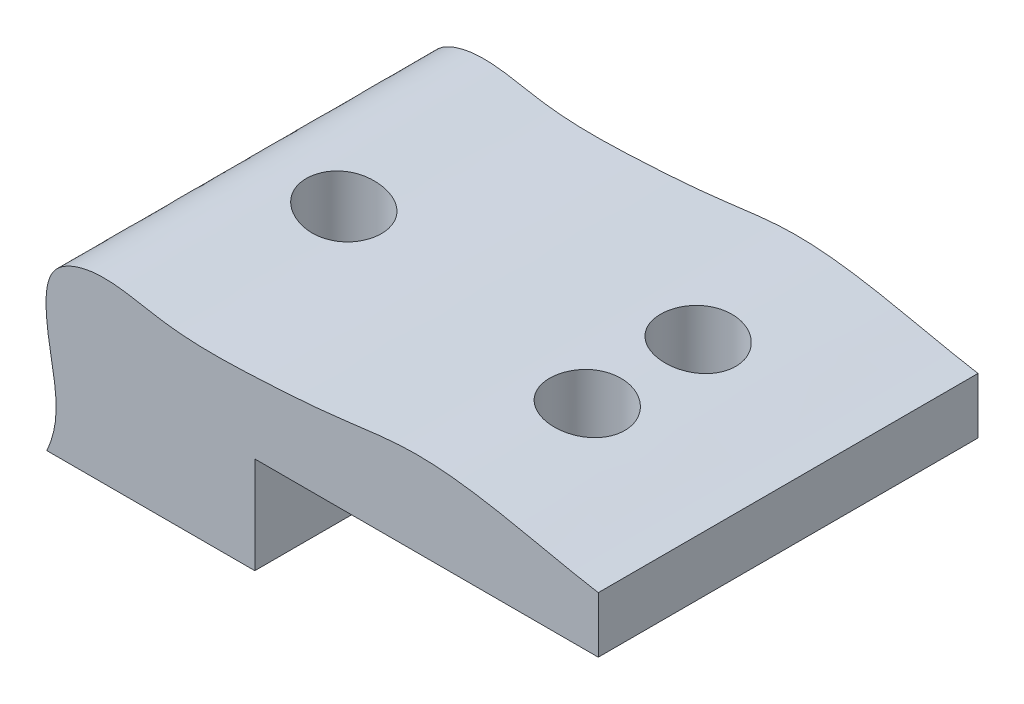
ISO-10303-21;
HEADER;
FILE_DESCRIPTION(('STEP AP214'),'2;1');
FILE_NAME('part.step','',(''),(''),'','','');
FILE_SCHEMA(('AUTOMOTIVE_DESIGN { 1 0 10303 214 1 1 1 1 }'));
ENDSEC;
DATA;
#1=APPLICATION_CONTEXT('core data for automotive mechanical design processes');
#2=APPLICATION_PROTOCOL_DEFINITION('international standard','automotive_design',2000,#1);
#3=PRODUCT_CONTEXT('',#1,'mechanical');
#4=PRODUCT('Part','Part','',(#3));
#5=PRODUCT_RELATED_PRODUCT_CATEGORY('part','',(#4));
#6=PRODUCT_DEFINITION_FORMATION('','',#4);
#7=PRODUCT_DEFINITION_CONTEXT('part definition',#1,'design');
#8=PRODUCT_DEFINITION('design','',#6,#7);
#9=PRODUCT_DEFINITION_SHAPE('','',#8);
#10=(LENGTH_UNIT() NAMED_UNIT(*) SI_UNIT(.MILLI.,.METRE.));
#11=(NAMED_UNIT(*) PLANE_ANGLE_UNIT() SI_UNIT($,.RADIAN.));
#12=(NAMED_UNIT(*) SI_UNIT($,.STERADIAN.) SOLID_ANGLE_UNIT());
#13=UNCERTAINTY_MEASURE_WITH_UNIT(LENGTH_MEASURE(1.E-05),#10,'distance_accuracy_value','');
#14=(GEOMETRIC_REPRESENTATION_CONTEXT(3) GLOBAL_UNCERTAINTY_ASSIGNED_CONTEXT((#13)) GLOBAL_UNIT_ASSIGNED_CONTEXT((#10,
#11,#12)) REPRESENTATION_CONTEXT('',''));
#15=CARTESIAN_POINT('',(0.,0.,0.));
#16=DIRECTION('',(0.,0.,1.));
#17=DIRECTION('',(1.,0.,0.));
#18=AXIS2_PLACEMENT_3D('',#15,#16,#17);
#19=CARTESIAN_POINT('',(-7.62191691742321,162.755280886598,-102.));
#20=CARTESIAN_POINT('',(-40.7298341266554,168.328576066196,-102.));
#21=CARTESIAN_POINT('',(-87.4452188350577,183.088140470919,-102.));
#22=CARTESIAN_POINT('',(-148.487157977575,173.311000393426,-102.));
#23=CARTESIAN_POINT('',(-192.067648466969,170.426961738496,-102.));
#24=CARTESIAN_POINT('',(-237.483766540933,169.225269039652,-102.));
#25=CARTESIAN_POINT('',(-273.222682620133,180.056314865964,-102.));
#26=CARTESIAN_POINT('',(-301.113613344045,167.556907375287,-102.));
#27=CARTESIAN_POINT('',(-302.938840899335,128.156812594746,-102.));
#28=CARTESIAN_POINT('',(-290.551932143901,103.671702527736,-102.));
#29=CARTESIAN_POINT('',(-301.080515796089,81.5,-102.));
#30=B_SPLINE_CURVE_WITH_KNOTS('',3,(#19,#20,#21,#22,#23,#24,#25,#26,#27,#28,#29),.UNSPECIFIED.,
.F.,.F.,(4,1,1,1,1,1,1,1,4),(0.,0.271046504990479,0.369012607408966,0.485907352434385,
0.616935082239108,0.726981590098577,0.771587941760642,0.834411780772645,1.),.UNSPECIFIED.);
#31=DIRECTION('',(0.,0.,1.));
#32=VECTOR('',#31,1.);
#33=SURFACE_OF_LINEAR_EXTRUSION('',#30,#32);
#34=CARTESIAN_POINT('',(-84.,176.961369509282,-49.5));
#35=CARTESIAN_POINT('',(-84.5592458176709,177.022210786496,-49.5000058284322));
#36=CARTESIAN_POINT('',(-85.1186269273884,177.080979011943,-49.4765358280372));
#37=CARTESIAN_POINT('',(-86.2340913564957,177.193886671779,-49.3827075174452));
#38=CARTESIAN_POINT('',(-86.7901739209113,177.248025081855,-49.3123388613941));
#39=CARTESIAN_POINT('',(-87.8954264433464,177.351295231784,-49.124987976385));
#40=CARTESIAN_POINT('',(-88.44458952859,177.400422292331,-49.0079626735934));
#41=CARTESIAN_POINT('',(-89.5315281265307,177.493343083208,-48.7280293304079));
#42=CARTESIAN_POINT('',(-90.0693042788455,177.53713711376,-48.5651238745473));
#43=CARTESIAN_POINT('',(-91.1295546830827,177.619261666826,-48.1945122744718));
#44=CARTESIAN_POINT('',(-91.6520306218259,177.657592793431,-47.9868110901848));
#45=CARTESIAN_POINT('',(-92.677958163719,177.728811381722,-47.5280005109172));
#46=CARTESIAN_POINT('',(-93.1814094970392,177.76169876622,-47.2768905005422));
#47=CARTESIAN_POINT('',(-94.1655064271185,177.822173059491,-46.7330630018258));
#48=CARTESIAN_POINT('',(-94.6461569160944,177.849761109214,-46.4403544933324));
#49=CARTESIAN_POINT('',(-95.5812632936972,177.899922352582,-45.815348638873));
#50=CARTESIAN_POINT('',(-96.0357193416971,177.92249557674,-45.4830515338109));
#51=CARTESIAN_POINT('',(-96.9133240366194,177.962931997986,-44.7826683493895));
#52=CARTESIAN_POINT('',(-97.3365935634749,177.980814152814,-44.4147348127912));
#53=CARTESIAN_POINT('',(-98.1508255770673,178.012462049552,-43.6445457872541));
#54=CARTESIAN_POINT('',(-98.5417881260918,178.026227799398,-43.2422903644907));
#55=CARTESIAN_POINT('',(-99.2886133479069,178.050181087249,-42.4062958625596));
#56=CARTESIAN_POINT('',(-99.6444747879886,178.06036849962,-41.9725556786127));
#57=CARTESIAN_POINT('',(-100.318537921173,178.077741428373,-41.076681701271));
#58=CARTESIAN_POINT('',(-100.636739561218,178.084926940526,-40.6145478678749));
#59=CARTESIAN_POINT('',(-101.23337756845,178.096887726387,-39.6649062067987));
#60=CARTESIAN_POINT('',(-101.511792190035,178.101661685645,-39.1773847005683));
#61=CARTESIAN_POINT('',(-102.026669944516,178.109366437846,-38.1806573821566));
#62=CARTESIAN_POINT('',(-102.263133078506,178.112297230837,-37.6714515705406));
#63=CARTESIAN_POINT('',(-102.692430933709,178.116845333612,-36.6349617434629));
#64=CARTESIAN_POINT('',(-102.885265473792,178.118462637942,-36.1076776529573));
#65=CARTESIAN_POINT('',(-103.225938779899,178.120845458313,-35.038766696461));
#66=CARTESIAN_POINT('',(-103.373777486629,178.121610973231,-34.4971398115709));
#67=CARTESIAN_POINT('',(-103.623655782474,178.122663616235,-33.402309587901));
#68=CARTESIAN_POINT('',(-103.725605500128,178.122949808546,-32.8490857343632));
#69=CARTESIAN_POINT('',(-103.882558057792,178.123308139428,-31.736017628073));
#70=CARTESIAN_POINT('',(-103.937560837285,178.123380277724,-31.1761733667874));
#71=CARTESIAN_POINT('',(-104.000228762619,178.123457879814,-30.0538405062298));
#72=CARTESIAN_POINT('',(-104.007893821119,178.123463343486,-29.4913519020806));
#73=CARTESIAN_POINT('',(-103.975831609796,178.123428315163,-28.3677271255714));
#74=CARTESIAN_POINT('',(-103.93610434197,178.123387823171,-27.8065909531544));
#75=CARTESIAN_POINT('',(-103.809512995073,178.123153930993,-26.689421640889));
#76=CARTESIAN_POINT('',(-103.722629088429,178.122960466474,-26.1333907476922));
#77=CARTESIAN_POINT('',(-103.502329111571,178.122190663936,-25.0306246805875));
#78=CARTESIAN_POINT('',(-103.368913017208,178.12161432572,-24.4838895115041));
#79=CARTESIAN_POINT('',(-103.056496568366,178.119736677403,-23.4035996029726));
#80=CARTESIAN_POINT('',(-102.877495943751,178.118435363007,-22.8700449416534));
#81=CARTESIAN_POINT('',(-102.475184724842,178.114669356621,-21.8199149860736));
#82=CARTESIAN_POINT('',(-102.251874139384,178.112204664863,-21.3033396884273));
#83=CARTESIAN_POINT('',(-101.762557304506,178.105597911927,-20.2908932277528));
#84=CARTESIAN_POINT('',(-101.496555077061,178.101456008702,-19.7950201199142));
#85=CARTESIAN_POINT('',(-100.923738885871,178.090928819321,-18.8274588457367));
#86=CARTESIAN_POINT('',(-100.616924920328,178.084543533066,-18.3557706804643));
#87=CARTESIAN_POINT('',(-99.9646853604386,178.068938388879,-17.4399480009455));
#88=CARTESIAN_POINT('',(-99.6192601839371,178.05971856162,-16.9958131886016));
#89=CARTESIAN_POINT('',(-98.8922772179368,178.037855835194,-16.1382616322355));
#90=CARTESIAN_POINT('',(-98.5107194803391,178.025212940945,-15.7248448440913));
#91=CARTESIAN_POINT('',(-97.7147632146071,177.995966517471,-14.9322172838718));
#92=CARTESIAN_POINT('',(-97.3004099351,177.979368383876,-14.5529608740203));
#93=CARTESIAN_POINT('',(-96.4414030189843,177.941705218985,-13.8307188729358));
#94=CARTESIAN_POINT('',(-95.9967494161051,177.920640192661,-13.4877332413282));
#95=CARTESIAN_POINT('',(-95.0803698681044,177.8736292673,-12.8404659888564));
#96=CARTESIAN_POINT('',(-94.6086445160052,177.847683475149,-12.5361835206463));
#97=CARTESIAN_POINT('',(-93.6415318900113,177.790600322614,-11.9684493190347));
#98=CARTESIAN_POINT('',(-93.146144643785,177.759462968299,-11.7049975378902));
#99=CARTESIAN_POINT('',(-92.1362422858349,177.691870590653,-11.2212016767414));
#100=CARTESIAN_POINT('',(-91.6217646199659,177.655425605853,-11.0007780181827));
#101=CARTESIAN_POINT('',(-90.5765169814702,177.577118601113,-10.603917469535));
#102=CARTESIAN_POINT('',(-90.0457470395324,177.535256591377,-10.4274804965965));
#103=CARTESIAN_POINT('',(-88.9717139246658,177.44619701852,-10.1197490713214));
#104=CARTESIAN_POINT('',(-88.4284506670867,177.398999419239,-9.98845492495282));
#105=CARTESIAN_POINT('',(-87.3332986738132,177.299489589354,-9.77182989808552));
#106=CARTESIAN_POINT('',(-86.7814099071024,177.247177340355,-9.6864991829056));
#107=CARTESIAN_POINT('',(-85.6711513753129,177.137621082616,-9.56208950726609));
#108=CARTESIAN_POINT('',(-85.1127666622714,177.080362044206,-9.52315722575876));
#109=CARTESIAN_POINT('',(-83.9951587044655,176.961540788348,-9.49218945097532));
#110=CARTESIAN_POINT('',(-83.4359354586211,176.899978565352,-9.50015401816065));
#111=CARTESIAN_POINT('',(-82.3205123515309,176.773148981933,-9.56281462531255));
#112=CARTESIAN_POINT('',(-81.7643126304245,176.707881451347,-9.61751281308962));
#113=CARTESIAN_POINT('',(-80.6587893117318,176.574344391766,-9.77316747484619));
#114=CARTESIAN_POINT('',(-80.109465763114,176.506074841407,-9.87412427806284));
#115=CARTESIAN_POINT('',(-79.0163246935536,176.366664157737,-10.1226908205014));
#116=CARTESIAN_POINT('',(-78.4726075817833,176.295502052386,-10.2707304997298));
#117=CARTESIAN_POINT('',(-77.3997605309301,176.151790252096,-10.6120746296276));
#118=CARTESIAN_POINT('',(-76.8706306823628,176.079240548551,-10.8053793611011));
#119=CARTESIAN_POINT('',(-75.8305837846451,175.93367186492,-11.2358982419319));
#120=CARTESIAN_POINT('',(-75.3196675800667,175.860652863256,-11.4731144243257));
#121=CARTESIAN_POINT('',(-74.3196005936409,175.715100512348,-11.9898130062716));
#122=CARTESIAN_POINT('',(-73.8304498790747,175.642567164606,-12.2692955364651));
#123=CARTESIAN_POINT('',(-72.8740089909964,175.498452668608,-12.8706993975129));
#124=CARTESIAN_POINT('',(-72.4068934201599,175.426881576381,-13.1929008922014));
#125=CARTESIAN_POINT('',(-71.5014860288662,175.286187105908,-13.8760199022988));
#126=CARTESIAN_POINT('',(-71.0631943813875,175.217063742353,-14.236937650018));
#127=CARTESIAN_POINT('',(-70.2185899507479,175.082221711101,-14.9950098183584));
#128=CARTESIAN_POINT('',(-69.8122770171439,175.016503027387,-15.3921640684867));
#129=CARTESIAN_POINT('',(-69.0345972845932,174.889388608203,-16.2199688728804));
#130=CARTESIAN_POINT('',(-68.6632302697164,174.827992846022,-16.650619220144));
#131=CARTESIAN_POINT('',(-67.9597744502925,174.710651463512,-17.5404272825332));
#132=CARTESIAN_POINT('',(-67.6275178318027,174.654682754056,-17.9994492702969));
#133=CARTESIAN_POINT('',(-67.0028674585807,174.548673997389,-18.9445126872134));
#134=CARTESIAN_POINT('',(-66.7104736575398,174.49863394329,-19.4305540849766));
#135=CARTESIAN_POINT('',(-66.1678034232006,174.405193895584,-20.4261813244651));
#136=CARTESIAN_POINT('',(-65.9175243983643,174.361793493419,-20.9357657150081));
#137=CARTESIAN_POINT('',(-65.4610136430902,174.282247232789,-21.9748426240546));
#138=CARTESIAN_POINT('',(-65.2547814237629,174.246101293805,-22.5043349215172));
#139=CARTESIAN_POINT('',(-64.8904787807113,174.182017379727,-23.5720922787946));
#140=CARTESIAN_POINT('',(-64.7317943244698,174.153974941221,-24.1101416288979));
#141=CARTESIAN_POINT('',(-64.460114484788,174.105843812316,-25.1980031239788));
#142=CARTESIAN_POINT('',(-64.3471187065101,174.085755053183,-25.747815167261));
#143=CARTESIAN_POINT('',(-64.1677136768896,174.053813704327,-26.8551903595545));
#144=CARTESIAN_POINT('',(-64.1013015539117,174.041960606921,-27.4127530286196));
#145=CARTESIAN_POINT('',(-64.0155813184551,174.026655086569,-28.5316016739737));
#146=CARTESIAN_POINT('',(-63.996272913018,174.023202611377,-29.0928876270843));
#147=CARTESIAN_POINT('',(-64.0048632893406,174.024737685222,-30.2086679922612));
#148=CARTESIAN_POINT('',(-64.0322253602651,174.029629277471,-30.7631667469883));
#149=CARTESIAN_POINT('',(-64.1329178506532,174.047601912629,-31.8678365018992));
#150=CARTESIAN_POINT('',(-64.2062478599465,174.060682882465,-32.4180075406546));
#151=CARTESIAN_POINT('',(-64.398304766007,174.094854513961,-33.5101037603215));
#152=CARTESIAN_POINT('',(-64.5170309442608,174.115945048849,-34.0520290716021));
#153=CARTESIAN_POINT('',(-64.7989653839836,174.165847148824,-35.1238178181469));
#154=CARTESIAN_POINT('',(-64.9621737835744,174.194658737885,-35.6536812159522));
#155=CARTESIAN_POINT('',(-65.3317911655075,174.259603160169,-36.6975329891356));
#156=CARTESIAN_POINT('',(-65.5381914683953,174.29573452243,-37.2115245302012));
#157=CARTESIAN_POINT('',(-65.9926610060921,174.374831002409,-38.2201911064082));
#158=CARTESIAN_POINT('',(-66.240730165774,174.417796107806,-38.7148661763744));
#159=CARTESIAN_POINT('',(-66.7767048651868,174.509979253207,-39.6815290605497));
#160=CARTESIAN_POINT('',(-67.0646105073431,174.559197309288,-40.1535168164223));
#161=CARTESIAN_POINT('',(-67.6781680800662,174.663224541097,-41.071631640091));
#162=CARTESIAN_POINT('',(-68.0038203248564,174.718033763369,-41.5177584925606));
#163=CARTESIAN_POINT('',(-68.6943044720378,174.833136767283,-42.3859088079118));
#164=CARTESIAN_POINT('',(-69.0595255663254,174.893483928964,-42.8076156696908));
#165=CARTESIAN_POINT('',(-69.8235613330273,175.018325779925,-43.6187470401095));
#166=CARTESIAN_POINT('',(-70.2223763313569,175.082820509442,-44.0081712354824));
#167=CARTESIAN_POINT('',(-71.0509186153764,175.21510954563,-44.7522594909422));
#168=CARTESIAN_POINT('',(-71.4806550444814,175.282904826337,-45.1069131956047));
#169=CARTESIAN_POINT('',(-72.3679536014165,175.420872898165,-45.7789817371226));
#170=CARTESIAN_POINT('',(-72.8255155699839,175.491045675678,-46.0963967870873));
#171=CARTESIAN_POINT('',(-73.7719732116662,175.633845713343,-46.6960960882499));
#172=CARTESIAN_POINT('',(-74.2612196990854,175.706493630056,-46.9778219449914));
#173=CARTESIAN_POINT('',(-75.2617350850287,175.852319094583,-47.498914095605));
#174=CARTESIAN_POINT('',(-75.7730054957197,175.925496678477,-47.7382774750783));
#175=CARTESIAN_POINT('',(-76.8135032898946,176.071348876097,-48.1727546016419));
#176=CARTESIAN_POINT('',(-77.3427127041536,176.144023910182,-48.3679112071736));
#177=CARTESIAN_POINT('',(-78.4157146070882,176.287993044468,-48.7128437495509));
#178=CARTESIAN_POINT('',(-78.9595036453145,176.359287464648,-48.8626303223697));
#179=CARTESIAN_POINT('',(-80.2438345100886,176.523370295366,-49.1585800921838));
#180=CARTESIAN_POINT('',(-80.9887842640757,176.61528342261,-49.2864248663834));
#181=CARTESIAN_POINT('',(-82.4890736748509,176.793182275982,-49.4571309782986));
#182=CARTESIAN_POINT('',(-83.2444133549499,176.879167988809,-49.4999921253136));
#183=CARTESIAN_POINT('',(-84.,176.961369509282,-49.5));
#184=B_SPLINE_CURVE_WITH_KNOTS('',3,(#34,#35,#36,#37,#38,#39,#40,#41,#42,#43,#44,#45,#46,#47,
#48,#49,#50,#51,#52,#53,#54,#55,#56,#57,#58,#59,#60,#61,#62,#63,#64,#65,#66,#67,#68,#69,#70,#71,
#72,#73,#74,#75,#76,#77,#78,#79,#80,#81,#82,#83,#84,#85,#86,#87,#88,#89,#90,#91,#92,#93,#94,#95,
#96,#97,#98,#99,#100,#101,#102,#103,#104,#105,#106,#107,#108,#109,#110,#111,#112,#113,#114,#115,
#116,#117,#118,#119,#120,#121,#122,#123,#124,#125,#126,#127,#128,#129,#130,#131,#132,#133,#134,
#135,#136,#137,#138,#139,#140,#141,#142,#143,#144,#145,#146,#147,#148,#149,#150,#151,#152,#153,
#154,#155,#156,#157,#158,#159,#160,#161,#162,#163,#164,#165,#166,#167,#168,#169,#170,#171,#172,
#173,#174,#175,#176,#177,#178,#179,#180,#181,#182,#183),.UNSPECIFIED.,.T.,.F.,(4,2,2,2,2,2,2,2,
2,2,2,2,2,2,2,2,2,2,2,2,2,2,2,2,2,2,2,2,2,2,2,2,2,2,2,2,2,2,2,2,2,2,2,2,2,2,2,2,2,2,2,2,2,2,2,2,
2,2,2,2,2,2,2,2,2,2,2,2,2,2,2,2,2,2,4),(0.,1.68698611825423,3.37434450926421,5.06326430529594,
6.75208897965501,8.44072675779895,10.1293884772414,11.8176862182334,13.5059736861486,
15.1873294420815,16.8686819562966,18.5500934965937,20.2315074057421,21.9138368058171,
23.5961661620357,25.2785025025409,26.960841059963,28.6464602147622,30.3320815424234,
32.0177059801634,33.703330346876,35.3896640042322,37.0759985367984,38.7623430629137,
40.4486872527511,42.1348726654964,43.8210581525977,45.5072253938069,47.1933902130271,
48.8772678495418,50.5611436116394,52.2449825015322,53.9288194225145,55.6095120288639,
57.2902014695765,58.9709023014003,60.6516091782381,62.3376152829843,64.0236235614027,
65.7097093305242,67.3958071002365,69.0977663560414,70.799736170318,72.501784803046,
74.2038386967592,75.9176650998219,77.631501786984,79.3453304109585,81.0591484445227,
82.7653218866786,84.471493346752,86.1775597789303,87.8836072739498,89.566565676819,
91.2495095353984,92.9323496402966,94.6151792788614,96.2787865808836,97.9423790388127,
99.6059451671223,101.269516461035,102.93275377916,104.595988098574,106.259226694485,
107.922479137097,109.60390378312,111.285344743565,112.96728496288,114.649215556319,
116.354859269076,118.060620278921,119.76472040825,121.468420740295,123.747671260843,
126.026926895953),.UNSPECIFIED.);
#185=CARTESIAN_POINT('',(-84.,176.961369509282,-49.5));
#186=VERTEX_POINT('',#185);
#187=EDGE_CURVE('E180',#186,#186,#184,.T.);
#188=ORIENTED_EDGE('',*,*,#187,.F.);
#189=EDGE_LOOP('',(#188));
#190=FACE_BOUND('',#189,.T.);
#191=CARTESIAN_POINT('',(-84.,176.961369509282,9.50000000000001));
#192=CARTESIAN_POINT('',(-84.5592458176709,177.022210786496,9.4999941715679));
#193=CARTESIAN_POINT('',(-85.1186269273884,177.080979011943,9.52346417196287));
#194=CARTESIAN_POINT('',(-86.2340913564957,177.193886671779,9.61729248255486));
#195=CARTESIAN_POINT('',(-86.7901739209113,177.248025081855,9.68766113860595));
#196=CARTESIAN_POINT('',(-87.8954264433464,177.351295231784,9.87501202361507));
#197=CARTESIAN_POINT('',(-88.44458952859,177.400422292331,9.99203732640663));
#198=CARTESIAN_POINT('',(-89.5315281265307,177.493343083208,10.2719706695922));
#199=CARTESIAN_POINT('',(-90.0693042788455,177.53713711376,10.4348761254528));
#200=CARTESIAN_POINT('',(-91.1295546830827,177.619261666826,10.8054877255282));
#201=CARTESIAN_POINT('',(-91.6520306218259,177.657592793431,11.0131889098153));
#202=CARTESIAN_POINT('',(-92.677958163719,177.728811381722,11.4719994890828));
#203=CARTESIAN_POINT('',(-93.1814094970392,177.76169876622,11.7231094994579));
#204=CARTESIAN_POINT('',(-94.1655064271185,177.822173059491,12.2669369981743));
#205=CARTESIAN_POINT('',(-94.6461569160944,177.849761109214,12.5596455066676));
#206=CARTESIAN_POINT('',(-95.5812632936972,177.899922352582,13.184651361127));
#207=CARTESIAN_POINT('',(-96.0357193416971,177.92249557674,13.5169484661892));
#208=CARTESIAN_POINT('',(-96.9133240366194,177.962931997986,14.2173316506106));
#209=CARTESIAN_POINT('',(-97.3365935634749,177.980814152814,14.5852651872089));
#210=CARTESIAN_POINT('',(-98.1508255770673,178.012462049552,15.355454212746));
#211=CARTESIAN_POINT('',(-98.5417881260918,178.026227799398,15.7577096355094));
#212=CARTESIAN_POINT('',(-99.2886133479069,178.050181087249,16.5937041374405));
#213=CARTESIAN_POINT('',(-99.6444747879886,178.06036849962,17.0274443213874));
#214=CARTESIAN_POINT('',(-100.318537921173,178.077741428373,17.923318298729));
#215=CARTESIAN_POINT('',(-100.636739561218,178.084926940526,18.3854521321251));
#216=CARTESIAN_POINT('',(-101.23337756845,178.096887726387,19.3350937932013));
#217=CARTESIAN_POINT('',(-101.511792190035,178.101661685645,19.8226152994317));
#218=CARTESIAN_POINT('',(-102.026669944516,178.109366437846,20.8193426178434));
#219=CARTESIAN_POINT('',(-102.263133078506,178.112297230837,21.3285484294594));
#220=CARTESIAN_POINT('',(-102.692430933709,178.116845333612,22.3650382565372));
#221=CARTESIAN_POINT('',(-102.885265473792,178.118462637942,22.8923223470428));
#222=CARTESIAN_POINT('',(-103.225938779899,178.120845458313,23.9612333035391));
#223=CARTESIAN_POINT('',(-103.373777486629,178.121610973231,24.5028601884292));
#224=CARTESIAN_POINT('',(-103.623655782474,178.122663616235,25.597690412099));
#225=CARTESIAN_POINT('',(-103.725605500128,178.122949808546,26.1509142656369));
#226=CARTESIAN_POINT('',(-103.882558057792,178.123308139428,27.2639823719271));
#227=CARTESIAN_POINT('',(-103.937560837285,178.123380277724,27.8238266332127));
#228=CARTESIAN_POINT('',(-104.000228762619,178.123457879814,28.9461594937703));
#229=CARTESIAN_POINT('',(-104.007893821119,178.123463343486,29.5086480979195));
#230=CARTESIAN_POINT('',(-103.975831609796,178.123428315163,30.6322728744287));
#231=CARTESIAN_POINT('',(-103.93610434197,178.123387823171,31.1934090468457));
#232=CARTESIAN_POINT('',(-103.809512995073,178.123153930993,32.3105783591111));
#233=CARTESIAN_POINT('',(-103.722629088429,178.122960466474,32.8666092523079));
#234=CARTESIAN_POINT('',(-103.502329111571,178.122190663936,33.9693753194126));
#235=CARTESIAN_POINT('',(-103.368913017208,178.12161432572,34.5161104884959));
#236=CARTESIAN_POINT('',(-103.056496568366,178.119736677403,35.5964003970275));
#237=CARTESIAN_POINT('',(-102.877495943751,178.118435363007,36.1299550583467));
#238=CARTESIAN_POINT('',(-102.475184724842,178.114669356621,37.1800850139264));
#239=CARTESIAN_POINT('',(-102.251874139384,178.112204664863,37.6966603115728));
#240=CARTESIAN_POINT('',(-101.762557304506,178.105597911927,38.7091067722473));
#241=CARTESIAN_POINT('',(-101.496555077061,178.101456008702,39.2049798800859));
#242=CARTESIAN_POINT('',(-100.923738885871,178.090928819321,40.1725411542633));
#243=CARTESIAN_POINT('',(-100.616924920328,178.084543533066,40.6442293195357));
#244=CARTESIAN_POINT('',(-99.9646853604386,178.068938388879,41.5600519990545));
#245=CARTESIAN_POINT('',(-99.6192601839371,178.05971856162,42.0041868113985));
#246=CARTESIAN_POINT('',(-98.8922772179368,178.037855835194,42.8617383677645));
#247=CARTESIAN_POINT('',(-98.5107194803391,178.025212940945,43.2751551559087));
#248=CARTESIAN_POINT('',(-97.7147632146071,177.995966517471,44.0677827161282));
#249=CARTESIAN_POINT('',(-97.3004099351,177.979368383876,44.4470391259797));
#250=CARTESIAN_POINT('',(-96.4414030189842,177.941705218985,45.1692811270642));
#251=CARTESIAN_POINT('',(-95.9967494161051,177.920640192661,45.5122667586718));
#252=CARTESIAN_POINT('',(-95.0803698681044,177.8736292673,46.1595340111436));
#253=CARTESIAN_POINT('',(-94.6086445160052,177.847683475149,46.4638164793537));
#254=CARTESIAN_POINT('',(-93.6415318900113,177.790600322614,47.0315506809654));
#255=CARTESIAN_POINT('',(-93.146144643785,177.759462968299,47.2950024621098));
#256=CARTESIAN_POINT('',(-92.1362422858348,177.691870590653,47.7787983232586));
#257=CARTESIAN_POINT('',(-91.6217646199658,177.655425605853,47.9992219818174));
#258=CARTESIAN_POINT('',(-90.5765169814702,177.577118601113,48.396082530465));
#259=CARTESIAN_POINT('',(-90.0457470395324,177.535256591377,48.5725195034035));
#260=CARTESIAN_POINT('',(-88.9717139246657,177.44619701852,48.8802509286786));
#261=CARTESIAN_POINT('',(-88.4284506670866,177.398999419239,49.0115450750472));
#262=CARTESIAN_POINT('',(-87.3332986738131,177.299489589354,49.2281701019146));
#263=CARTESIAN_POINT('',(-86.7814099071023,177.247177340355,49.3135008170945));
#264=CARTESIAN_POINT('',(-85.6711513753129,177.137621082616,49.437910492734));
#265=CARTESIAN_POINT('',(-85.1127666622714,177.080362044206,49.4768427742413));
#266=CARTESIAN_POINT('',(-83.9951587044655,176.961540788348,49.5078105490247));
#267=CARTESIAN_POINT('',(-83.4359354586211,176.899978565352,49.4998459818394));
#268=CARTESIAN_POINT('',(-82.3205123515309,176.773148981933,49.4371853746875));
#269=CARTESIAN_POINT('',(-81.7643126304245,176.707881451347,49.3824871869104));
#270=CARTESIAN_POINT('',(-80.6587893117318,176.574344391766,49.2268325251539));
#271=CARTESIAN_POINT('',(-80.109465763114,176.506074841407,49.1258757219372));
#272=CARTESIAN_POINT('',(-79.0163246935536,176.366664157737,48.8773091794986));
#273=CARTESIAN_POINT('',(-78.4726075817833,176.295502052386,48.7292695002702));
#274=CARTESIAN_POINT('',(-77.3997605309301,176.151790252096,48.3879253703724));
#275=CARTESIAN_POINT('',(-76.8706306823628,176.079240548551,48.1946206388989));
#276=CARTESIAN_POINT('',(-75.8305837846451,175.93367186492,47.7641017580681));
#277=CARTESIAN_POINT('',(-75.3196675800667,175.860652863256,47.5268855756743));
#278=CARTESIAN_POINT('',(-74.3196005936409,175.715100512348,47.0101869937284));
#279=CARTESIAN_POINT('',(-73.8304498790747,175.642567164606,46.7307044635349));
#280=CARTESIAN_POINT('',(-72.8740089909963,175.498452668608,46.1293006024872));
#281=CARTESIAN_POINT('',(-72.4068934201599,175.426881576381,45.8070991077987));
#282=CARTESIAN_POINT('',(-71.5014860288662,175.286187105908,45.1239800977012));
#283=CARTESIAN_POINT('',(-71.0631943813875,175.217063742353,44.763062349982));
#284=CARTESIAN_POINT('',(-70.2185899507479,175.082221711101,44.0049901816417));
#285=CARTESIAN_POINT('',(-69.8122770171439,175.016503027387,43.6078359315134));
#286=CARTESIAN_POINT('',(-69.0345972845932,174.889388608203,42.7800311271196));
#287=CARTESIAN_POINT('',(-68.6632302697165,174.827992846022,42.349380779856));
#288=CARTESIAN_POINT('',(-67.9597744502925,174.710651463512,41.4595727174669));
#289=CARTESIAN_POINT('',(-67.6275178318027,174.654682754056,41.0005507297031));
#290=CARTESIAN_POINT('',(-67.0028674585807,174.548673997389,40.0554873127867));
#291=CARTESIAN_POINT('',(-66.7104736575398,174.49863394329,39.5694459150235));
#292=CARTESIAN_POINT('',(-66.1678034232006,174.405193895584,38.573818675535));
#293=CARTESIAN_POINT('',(-65.9175243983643,174.361793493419,38.064234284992));
#294=CARTESIAN_POINT('',(-65.4610136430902,174.282247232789,37.0251573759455));
#295=CARTESIAN_POINT('',(-65.2547814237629,174.246101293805,36.4956650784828));
#296=CARTESIAN_POINT('',(-64.8904787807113,174.182017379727,35.4279077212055));
#297=CARTESIAN_POINT('',(-64.7317943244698,174.153974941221,34.8898583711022));
#298=CARTESIAN_POINT('',(-64.460114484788,174.105843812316,33.8019968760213));
#299=CARTESIAN_POINT('',(-64.3471187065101,174.085755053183,33.2521848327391));
#300=CARTESIAN_POINT('',(-64.1677136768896,174.053813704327,32.1448096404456));
#301=CARTESIAN_POINT('',(-64.1013015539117,174.041960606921,31.5872469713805));
#302=CARTESIAN_POINT('',(-64.0155813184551,174.026655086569,30.4683983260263));
#303=CARTESIAN_POINT('',(-63.996272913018,174.023202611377,29.9071123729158));
#304=CARTESIAN_POINT('',(-64.0048632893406,174.024737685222,28.7913320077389));
#305=CARTESIAN_POINT('',(-64.0322253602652,174.029629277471,28.2368332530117));
#306=CARTESIAN_POINT('',(-64.1329178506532,174.047601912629,27.1321634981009));
#307=CARTESIAN_POINT('',(-64.2062478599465,174.060682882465,26.5819924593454));
#308=CARTESIAN_POINT('',(-64.398304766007,174.094854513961,25.4898962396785));
#309=CARTESIAN_POINT('',(-64.5170309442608,174.115945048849,24.9479709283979));
#310=CARTESIAN_POINT('',(-64.7989653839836,174.165847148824,23.8761821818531));
#311=CARTESIAN_POINT('',(-64.9621737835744,174.194658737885,23.3463187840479));
#312=CARTESIAN_POINT('',(-65.3317911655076,174.259603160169,22.3024670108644));
#313=CARTESIAN_POINT('',(-65.5381914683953,174.29573452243,21.7884754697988));
#314=CARTESIAN_POINT('',(-65.9926610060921,174.374831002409,20.7798088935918));
#315=CARTESIAN_POINT('',(-66.240730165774,174.417796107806,20.2851338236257));
#316=CARTESIAN_POINT('',(-66.7767048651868,174.509979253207,19.3184709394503));
#317=CARTESIAN_POINT('',(-67.0646105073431,174.559197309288,18.8464831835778));
#318=CARTESIAN_POINT('',(-67.6781680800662,174.663224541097,17.928368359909));
#319=CARTESIAN_POINT('',(-68.0038203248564,174.718033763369,17.4822415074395));
#320=CARTESIAN_POINT('',(-68.6943044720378,174.833136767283,16.6140911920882));
#321=CARTESIAN_POINT('',(-69.0595255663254,174.893483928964,16.1923843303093));
#322=CARTESIAN_POINT('',(-69.8235613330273,175.018325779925,15.3812529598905));
#323=CARTESIAN_POINT('',(-70.2223763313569,175.082820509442,14.9918287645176));
#324=CARTESIAN_POINT('',(-71.0509186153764,175.21510954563,14.2477405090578));
#325=CARTESIAN_POINT('',(-71.4806550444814,175.282904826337,13.8930868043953));
#326=CARTESIAN_POINT('',(-72.3679536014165,175.420872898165,13.2210182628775));
#327=CARTESIAN_POINT('',(-72.8255155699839,175.491045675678,12.9036032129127));
#328=CARTESIAN_POINT('',(-73.7719732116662,175.633845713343,12.3039039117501));
#329=CARTESIAN_POINT('',(-74.2612196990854,175.706493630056,12.0221780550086));
#330=CARTESIAN_POINT('',(-75.2617350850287,175.852319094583,11.5010859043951));
#331=CARTESIAN_POINT('',(-75.7730054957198,175.925496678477,11.2617225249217));
#332=CARTESIAN_POINT('',(-76.8135032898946,176.071348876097,10.8272453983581));
#333=CARTESIAN_POINT('',(-77.3427127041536,176.144023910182,10.6320887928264));
#334=CARTESIAN_POINT('',(-78.4157146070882,176.287993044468,10.2871562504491));
#335=CARTESIAN_POINT('',(-78.9595036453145,176.359287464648,10.1373696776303));
#336=CARTESIAN_POINT('',(-80.2438345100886,176.523370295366,9.84141990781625));
#337=CARTESIAN_POINT('',(-80.9887842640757,176.61528342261,9.71357513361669));
#338=CARTESIAN_POINT('',(-82.4890736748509,176.793182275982,9.54286902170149));
#339=CARTESIAN_POINT('',(-83.2444133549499,176.879167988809,9.50000787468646));
#340=CARTESIAN_POINT('',(-84.,176.961369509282,9.50000000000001));
#341=B_SPLINE_CURVE_WITH_KNOTS('',3,(#191,#192,#193,#194,#195,#196,#197,#198,#199,#200,#201,
#202,#203,#204,#205,#206,#207,#208,#209,#210,#211,#212,#213,#214,#215,#216,#217,#218,#219,#220,
#221,#222,#223,#224,#225,#226,#227,#228,#229,#230,#231,#232,#233,#234,#235,#236,#237,#238,#239,
#240,#241,#242,#243,#244,#245,#246,#247,#248,#249,#250,#251,#252,#253,#254,#255,#256,#257,#258,
#259,#260,#261,#262,#263,#264,#265,#266,#267,#268,#269,#270,#271,#272,#273,#274,#275,#276,#277,
#278,#279,#280,#281,#282,#283,#284,#285,#286,#287,#288,#289,#290,#291,#292,#293,#294,#295,#296,
#297,#298,#299,#300,#301,#302,#303,#304,#305,#306,#307,#308,#309,#310,#311,#312,#313,#314,#315,
#316,#317,#318,#319,#320,#321,#322,#323,#324,#325,#326,#327,#328,#329,#330,#331,#332,#333,#334,
#335,#336,#337,#338,#339,#340),.UNSPECIFIED.,.T.,.F.,(4,2,2,2,2,2,2,2,2,2,2,2,2,2,2,2,2,2,2,2,2,
2,2,2,2,2,2,2,2,2,2,2,2,2,2,2,2,2,2,2,2,2,2,2,2,2,2,2,2,2,2,2,2,2,2,2,2,2,2,2,2,2,2,2,2,2,2,2,2,
2,2,2,2,2,4),(0.,1.68698611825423,3.37434450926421,5.06326430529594,6.75208897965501,
8.44072675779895,10.1293884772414,11.8176862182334,13.5059736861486,15.1873294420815,
16.8686819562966,18.5500934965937,20.2315074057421,21.9138368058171,23.5961661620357,
25.2785025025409,26.960841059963,28.6464602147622,30.3320815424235,32.0177059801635,
33.703330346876,35.3896640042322,37.0759985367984,38.7623430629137,40.4486872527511,
42.1348726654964,43.8210581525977,45.5072253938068,47.1933902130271,48.8772678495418,
50.5611436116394,52.2449825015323,53.9288194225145,55.609512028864,57.2902014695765,
58.9709023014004,60.6516091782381,62.3376152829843,64.0236235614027,65.7097093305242,
67.3958071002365,69.0977663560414,70.799736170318,72.501784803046,74.2038386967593,
75.9176650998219,77.631501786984,79.3453304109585,81.0591484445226,82.7653218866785,
84.471493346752,86.1775597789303,87.8836072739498,89.566565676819,91.2495095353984,
92.9323496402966,94.6151792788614,96.2787865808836,97.9423790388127,99.6059451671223,
101.269516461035,102.93275377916,104.595988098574,106.259226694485,107.922479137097,
109.60390378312,111.285344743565,112.96728496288,114.649215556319,116.354859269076,
118.060620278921,119.76472040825,121.468420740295,123.747671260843,126.026926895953),.UNSPECIFIED.);
#342=CARTESIAN_POINT('',(-84.,176.961369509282,9.50000000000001));
#343=VERTEX_POINT('',#342);
#344=EDGE_CURVE('E204',#343,#343,#341,.T.);
#345=ORIENTED_EDGE('',*,*,#344,.F.);
#346=EDGE_LOOP('',(#345));
#347=FACE_BOUND('',#346,.T.);
#348=CARTESIAN_POINT('',(-243.,172.574085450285,-20.));
#349=CARTESIAN_POINT('',(-243.569277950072,172.670604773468,-19.999996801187));
#350=CARTESIAN_POINT('',(-244.138271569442,172.769446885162,-19.9756777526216));
#351=CARTESIAN_POINT('',(-245.271761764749,172.969712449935,-19.8787030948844));
#352=CARTESIAN_POINT('',(-245.836257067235,173.071136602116,-19.8060342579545));
#353=CARTESIAN_POINT('',(-246.957601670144,173.274608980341,-19.6127871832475));
#354=CARTESIAN_POINT('',(-247.514441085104,173.376657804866,-19.4921521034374));
#355=CARTESIAN_POINT('',(-248.616017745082,173.579243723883,-19.2037624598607));
#356=CARTESIAN_POINT('',(-249.160755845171,173.679780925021,-19.0360112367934));
#357=CARTESIAN_POINT('',(-250.23448527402,173.877489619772,-18.6544055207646));
#358=CARTESIAN_POINT('',(-250.763476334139,173.974661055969,-18.4405502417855));
#359=CARTESIAN_POINT('',(-251.802006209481,174.163981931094,-17.9680310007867));
#360=CARTESIAN_POINT('',(-252.311544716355,174.256131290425,-17.7093663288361));
#361=CARTESIAN_POINT('',(-253.307264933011,174.433980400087,-17.1489513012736));
#362=CARTESIAN_POINT('',(-253.793455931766,174.519682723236,-16.8472182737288));
#363=CARTESIAN_POINT('',(-254.739040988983,174.68359807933,-16.2025409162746));
#364=CARTESIAN_POINT('',(-255.198435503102,174.761811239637,-15.8595972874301));
#365=CARTESIAN_POINT('',(-256.08176951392,174.909155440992,-15.138971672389));
#366=CARTESIAN_POINT('',(-256.506055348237,174.978380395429,-14.7617334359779));
#367=CARTESIAN_POINT('',(-257.321669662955,175.10839676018,-13.9718309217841));
#368=CARTESIAN_POINT('',(-257.712998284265,175.169188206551,-13.5591667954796));
#369=CARTESIAN_POINT('',(-258.459602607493,175.282254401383,-12.7013388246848));
#370=CARTESIAN_POINT('',(-258.814878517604,175.334529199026,-12.2561751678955));
#371=CARTESIAN_POINT('',(-259.486545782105,175.430748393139,-11.3365777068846));
#372=CARTESIAN_POINT('',(-259.80293763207,175.474692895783,-10.8621442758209));
#373=CARTESIAN_POINT('',(-260.38834991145,175.553842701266,-9.89733518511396));
#374=CARTESIAN_POINT('',(-260.658196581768,175.589206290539,-9.40747356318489));
#375=CARTESIAN_POINT('',(-261.156076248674,175.652821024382,-8.40650582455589));
#376=CARTESIAN_POINT('',(-261.384109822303,175.681072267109,-7.89540000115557));
#377=CARTESIAN_POINT('',(-261.796633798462,175.73102339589,-6.85561026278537));
#378=CARTESIAN_POINT('',(-261.981124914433,175.752723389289,-6.32692663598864));
#379=CARTESIAN_POINT('',(-262.305183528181,175.790122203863,-5.25575810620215));
#380=CARTESIAN_POINT('',(-262.444750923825,175.805821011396,-4.71327317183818));
#381=CARTESIAN_POINT('',(-262.677545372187,175.831649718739,-3.62014963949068));
#382=CARTESIAN_POINT('',(-262.770920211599,175.841797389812,-3.06954292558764));
#383=CARTESIAN_POINT('',(-262.911314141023,175.856944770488,-1.9623828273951));
#384=CARTESIAN_POINT('',(-262.958333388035,175.861944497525,-1.40582946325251));
#385=CARTESIAN_POINT('',(-263.005672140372,175.866977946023,-0.290714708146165));
#386=CARTESIAN_POINT('',(-263.005991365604,175.867011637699,0.267846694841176));
#387=CARTESIAN_POINT('',(-262.95992712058,175.862114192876,1.38301960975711));
#388=CARTESIAN_POINT('',(-262.913543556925,175.85718304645,1.9396311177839));
#389=CARTESIAN_POINT('',(-262.774289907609,175.842163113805,3.04794102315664));
#390=CARTESIAN_POINT('',(-262.681337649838,175.832065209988,3.59962897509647));
#391=CARTESIAN_POINT('',(-262.449591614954,175.806363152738,4.69316156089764));
#392=CARTESIAN_POINT('',(-262.31079779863,175.790758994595,5.23500618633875));
#393=CARTESIAN_POINT('',(-261.988403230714,175.753574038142,6.30497650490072));
#394=CARTESIAN_POINT('',(-261.804803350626,175.731993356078,6.83310246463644));
#395=CARTESIAN_POINT('',(-261.394171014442,175.682308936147,7.87187309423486));
#396=CARTESIAN_POINT('',(-261.16713864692,175.654205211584,8.38251779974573));
#397=CARTESIAN_POINT('',(-260.671630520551,175.590950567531,9.38212756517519));
#398=CARTESIAN_POINT('',(-260.403200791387,175.555807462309,9.8711159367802));
#399=CARTESIAN_POINT('',(-259.826754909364,175.477953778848,10.8245389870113));
#400=CARTESIAN_POINT('',(-259.51873883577,175.435243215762,11.2889737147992));
#401=CARTESIAN_POINT('',(-258.865485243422,175.341881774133,12.189996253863));
#402=CARTESIAN_POINT('',(-258.520249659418,175.29123130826,12.6265855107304));
#403=CARTESIAN_POINT('',(-257.795172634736,175.181802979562,13.4689154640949));
#404=CARTESIAN_POINT('',(-257.415331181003,175.12302511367,13.8746561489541));
#405=CARTESIAN_POINT('',(-256.624005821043,174.997413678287,14.6524464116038));
#406=CARTESIAN_POINT('',(-256.212529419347,174.930582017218,15.0245039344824));
#407=CARTESIAN_POINT('',(-255.360914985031,174.789187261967,15.7325918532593));
#408=CARTESIAN_POINT('',(-254.920776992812,174.714624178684,16.0686222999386));
#409=CARTESIAN_POINT('',(-254.01499769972,174.558391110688,16.7025577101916));
#410=CARTESIAN_POINT('',(-253.549354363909,174.476720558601,17.000459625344));
#411=CARTESIAN_POINT('',(-252.595873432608,174.307202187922,17.5563023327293));
#412=CARTESIAN_POINT('',(-252.108035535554,174.219354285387,17.814242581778));
#413=CARTESIAN_POINT('',(-251.106311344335,174.037376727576,18.2920771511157));
#414=CARTESIAN_POINT('',(-250.592150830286,173.943174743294,18.5113690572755));
#415=CARTESIAN_POINT('',(-249.54788846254,173.751152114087,18.9059970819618));
#416=CARTESIAN_POINT('',(-249.017786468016,173.653331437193,19.0813328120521));
#417=CARTESIAN_POINT('',(-247.945026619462,173.455763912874,19.3870532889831));
#418=CARTESIAN_POINT('',(-247.4023666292,173.356016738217,19.5174303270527));
#419=CARTESIAN_POINT('',(-246.308057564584,173.156468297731,19.7324022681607));
#420=CARTESIAN_POINT('',(-245.756408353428,173.056667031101,19.8169964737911));
#421=CARTESIAN_POINT('',(-244.635555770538,172.856794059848,19.9411573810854));
#422=CARTESIAN_POINT('',(-244.066231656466,172.756763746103,19.9797039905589));
#423=CARTESIAN_POINT('',(-242.925666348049,172.56074507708,20.0079958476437));
#424=CARTESIAN_POINT('',(-242.354425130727,172.464756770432,19.9977405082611));
#425=CARTESIAN_POINT('',(-241.214009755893,172.278825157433,19.9282847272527));
#426=CARTESIAN_POINT('',(-240.644835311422,172.188880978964,19.8690913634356));
#427=CARTESIAN_POINT('',(-239.512495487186,172.016872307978,19.7018982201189));
#428=CARTESIAN_POINT('',(-238.949329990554,171.934807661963,19.5938993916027));
#429=CARTESIAN_POINT('',(-237.83883996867,171.779476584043,19.3309284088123));
#430=CARTESIAN_POINT('',(-237.291413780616,171.706131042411,19.1764322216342));
#431=CARTESIAN_POINT('',(-236.210820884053,171.567239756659,18.8210132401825));
#432=CARTESIAN_POINT('',(-235.677654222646,171.5016940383,18.6200902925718));
#433=CARTESIAN_POINT('',(-234.629671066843,171.378200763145,18.1731150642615));
#434=CARTESIAN_POINT('',(-234.114854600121,171.320253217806,17.9270627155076));
#435=CARTESIAN_POINT('',(-233.107541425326,171.21162778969,17.3915101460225));
#436=CARTESIAN_POINT('',(-232.615044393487,171.160949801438,17.102010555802));
#437=CARTESIAN_POINT('',(-231.664956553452,171.067303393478,16.4872995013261));
#438=CARTESIAN_POINT('',(-231.206891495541,171.02421072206,16.1628396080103));
#439=CARTESIAN_POINT('',(-230.319327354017,170.944150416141,15.4762823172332));
#440=CARTESIAN_POINT('',(-229.889827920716,170.907182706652,15.1141853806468));
#441=CARTESIAN_POINT('',(-229.062588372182,170.838863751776,14.3549207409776));
#442=CARTESIAN_POINT('',(-228.664846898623,170.807512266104,13.9577545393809));
#443=CARTESIAN_POINT('',(-227.904032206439,170.749896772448,13.1311568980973));
#444=CARTESIAN_POINT('',(-227.540959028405,170.723632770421,12.7017254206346));
#445=CARTESIAN_POINT('',(-226.853316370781,170.675751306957,11.8151703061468));
#446=CARTESIAN_POINT('',(-226.528620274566,170.654118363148,11.3581457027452));
#447=CARTESIAN_POINT('',(-225.918662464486,170.614892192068,10.4183362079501));
#448=CARTESIAN_POINT('',(-225.63340062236,170.597298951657,9.93555140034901));
#449=CARTESIAN_POINT('',(-225.104368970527,170.565696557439,8.9476450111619));
#450=CARTESIAN_POINT('',(-224.860599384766,170.551687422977,8.44252330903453));
#451=CARTESIAN_POINT('',(-224.416307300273,170.526849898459,7.41352971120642));
#452=CARTESIAN_POINT('',(-224.215784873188,170.516021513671,6.88965778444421));
#453=CARTESIAN_POINT('',(-223.859250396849,170.497195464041,5.82635772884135));
#454=CARTESIAN_POINT('',(-223.703282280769,170.489200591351,5.28691481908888));
#455=CARTESIAN_POINT('',(-223.437237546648,170.475785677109,4.19679757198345));
#456=CARTESIAN_POINT('',(-223.327160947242,170.470365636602,3.64612323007));
#457=CARTESIAN_POINT('',(-223.15368625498,170.4619067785,2.53744872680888));
#458=CARTESIAN_POINT('',(-223.090288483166,170.458867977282,1.97944851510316));
#459=CARTESIAN_POINT('',(-223.010625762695,170.455059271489,0.860085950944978));
#460=CARTESIAN_POINT('',(-222.994360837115,170.454289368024,0.298723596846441));
#461=CARTESIAN_POINT('',(-223.009086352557,170.454989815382,-0.82385549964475));
#462=CARTESIAN_POINT('',(-223.040116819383,170.456462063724,-1.38507171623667));
#463=CARTESIAN_POINT('',(-223.149284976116,170.461705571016,-2.50289312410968));
#464=CARTESIAN_POINT('',(-223.227422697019,170.46547683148,-3.05949831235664));
#465=CARTESIAN_POINT('',(-223.430246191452,170.475456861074,-4.16414223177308));
#466=CARTESIAN_POINT('',(-223.554932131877,170.481665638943,-4.71218093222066));
#467=CARTESIAN_POINT('',(-223.849957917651,170.496739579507,-5.79579165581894));
#468=CARTESIAN_POINT('',(-224.020297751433,170.505604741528,-6.33136368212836));
#469=CARTESIAN_POINT('',(-224.405411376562,170.52628626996,-7.3862405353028));
#470=CARTESIAN_POINT('',(-224.620186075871,170.538102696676,-7.90554502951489));
#471=CARTESIAN_POINT('',(-225.092620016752,170.565050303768,-8.92417743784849));
#472=CARTESIAN_POINT('',(-225.350279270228,170.580181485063,-9.42350534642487));
#473=CARTESIAN_POINT('',(-225.906608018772,170.614181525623,-10.3986065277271));
#474=CARTESIAN_POINT('',(-226.205275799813,170.633050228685,-10.8743807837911));
#475=CARTESIAN_POINT('',(-226.841461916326,170.674997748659,-11.7990068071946));
#476=CARTESIAN_POINT('',(-227.178980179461,170.698076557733,-12.2478586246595));
#477=CARTESIAN_POINT('',(-227.890066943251,170.74892630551,-13.1150306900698));
#478=CARTESIAN_POINT('',(-228.263600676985,170.776692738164,-13.5333797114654));
#479=CARTESIAN_POINT('',(-229.044260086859,170.837455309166,-14.3370552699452));
#480=CARTESIAN_POINT('',(-229.451385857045,170.870451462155,-14.7223817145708));
#481=CARTESIAN_POINT('',(-230.296330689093,170.942201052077,-15.4573733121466));
#482=CARTESIAN_POINT('',(-230.7341563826,170.980955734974,-15.8070307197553));
#483=CARTESIAN_POINT('',(-231.637187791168,171.064712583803,-16.4681396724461));
#484=CARTESIAN_POINT('',(-232.102393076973,171.109714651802,-16.7795918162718));
#485=CARTESIAN_POINT('',(-233.056465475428,171.206385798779,-17.3619784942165));
#486=CARTESIAN_POINT('',(-233.545318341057,171.25805089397,-17.6329370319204));
#487=CARTESIAN_POINT('',(-234.543365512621,171.368448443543,-18.1327553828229));
#488=CARTESIAN_POINT('',(-235.052561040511,171.427181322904,-18.3616126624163));
#489=CARTESIAN_POINT('',(-236.086955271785,171.551921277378,-18.7755119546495));
#490=CARTESIAN_POINT('',(-236.612136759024,171.617920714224,-18.9605993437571));
#491=CARTESIAN_POINT('',(-237.675102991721,171.757399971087,-19.2861161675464));
#492=CARTESIAN_POINT('',(-238.212884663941,171.830877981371,-19.4265563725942));
#493=CARTESIAN_POINT('',(-239.104203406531,171.957825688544,-19.6201576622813));
#494=CARTESIAN_POINT('',(-239.455228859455,172.009114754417,-19.686594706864));
#495=CARTESIAN_POINT('',(-240.159819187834,172.114788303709,-19.8005220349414));
#496=CARTESIAN_POINT('',(-240.513383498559,172.169172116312,-19.8480164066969));
#497=CARTESIAN_POINT('',(-241.222125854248,172.280685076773,-19.924010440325));
#498=CARTESIAN_POINT('',(-241.577303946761,172.337814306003,-19.9525095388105));
#499=CARTESIAN_POINT('',(-242.288358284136,172.454354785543,-19.9905074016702));
#500=CARTESIAN_POINT('',(-242.644234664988,172.513766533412,-20.0000019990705));
#501=CARTESIAN_POINT('',(-243.,172.574085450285,-20.));
#502=B_SPLINE_CURVE_WITH_KNOTS('',3,(#348,#349,#350,#351,#352,#353,#354,#355,#356,#357,#358,
#359,#360,#361,#362,#363,#364,#365,#366,#367,#368,#369,#370,#371,#372,#373,#374,#375,#376,#377,
#378,#379,#380,#381,#382,#383,#384,#385,#386,#387,#388,#389,#390,#391,#392,#393,#394,#395,#396,
#397,#398,#399,#400,#401,#402,#403,#404,#405,#406,#407,#408,#409,#410,#411,#412,#413,#414,#415,
#416,#417,#418,#419,#420,#421,#422,#423,#424,#425,#426,#427,#428,#429,#430,#431,#432,#433,#434,
#435,#436,#437,#438,#439,#440,#441,#442,#443,#444,#445,#446,#447,#448,#449,#450,#451,#452,#453,
#454,#455,#456,#457,#458,#459,#460,#461,#462,#463,#464,#465,#466,#467,#468,#469,#470,#471,#472,
#473,#474,#475,#476,#477,#478,#479,#480,#481,#482,#483,#484,#485,#486,#487,#488,#489,#490,#491,
#492,#493,#494,#495,#496,#497,#498,#499,#500,#501),.UNSPECIFIED.,.T.,.F.,(4,2,2,2,2,2,2,2,2,2,2,
2,2,2,2,2,2,2,2,2,2,2,2,2,2,2,2,2,2,2,2,2,2,2,2,2,2,2,2,2,2,2,2,2,2,2,2,2,2,2,2,2,2,2,2,2,2,2,2,
2,2,2,2,2,2,2,2,2,2,2,2,2,2,2,2,2,4),(0.,1.73188521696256,3.46424444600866,5.19866274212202,
6.93295809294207,8.66728301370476,10.4016354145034,12.1352919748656,13.8689190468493,
15.5826539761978,17.2963815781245,19.0100992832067,20.7237951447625,22.4029516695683,
24.0820850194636,25.7611908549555,27.4403005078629,29.1140027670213,30.7876993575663,
32.4614059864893,34.1351159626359,35.811789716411,37.4884649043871,39.1651074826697,
40.8417466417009,42.5165348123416,44.1913196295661,45.8660174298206,47.5407158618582,
49.2150182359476,50.8893182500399,52.563752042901,54.2382085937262,55.9368165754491,
57.6354395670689,59.3343536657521,61.0332936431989,62.7692108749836,64.5051489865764,
66.2408360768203,67.9764893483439,69.6949474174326,71.4134111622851,73.1318774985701,
74.8503188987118,76.537272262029,78.2242049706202,79.9110654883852,81.5979279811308,
83.2790597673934,84.9601860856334,86.6413214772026,88.3224596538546,90.0052498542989,
91.6880407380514,93.3708431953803,95.0536464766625,96.7378746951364,98.4221040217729,
100.106339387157,101.790574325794,103.474843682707,105.159113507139,106.843312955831,
108.527509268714,110.210095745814,111.892686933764,113.575642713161,115.258572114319,
116.940499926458,118.622528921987,120.302806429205,121.982678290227,123.064969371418,
124.147026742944,125.229116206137,126.311442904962),.UNSPECIFIED.);
#503=CARTESIAN_POINT('',(-243.,172.574085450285,-20.));
#504=VERTEX_POINT('',#503);
#505=EDGE_CURVE('E212',#504,#504,#502,.T.);
#506=ORIENTED_EDGE('',*,*,#505,.F.);
#507=EDGE_LOOP('',(#506));
#508=FACE_BOUND('',#507,.T.);
#509=DIRECTION('',(0.,0.,1.));
#510=VECTOR('',#509,1.);
#511=CARTESIAN_POINT('',(-301.080515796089,81.5,-102.));
#512=LINE('',#511,#510);
#513=CARTESIAN_POINT('',(-301.080515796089,81.5,-102.));
#514=VERTEX_POINT('',#513);
#515=CARTESIAN_POINT('',(-301.080515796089,81.5,100.));
#516=VERTEX_POINT('',#515);
#517=EDGE_CURVE('E54',#514,#516,#512,.T.);
#518=ORIENTED_EDGE('',*,*,#517,.T.);
#519=CARTESIAN_POINT('',(-7.62191691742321,162.755280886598,100.));
#520=CARTESIAN_POINT('',(-40.7298341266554,168.328576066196,100.));
#521=CARTESIAN_POINT('',(-87.4452188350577,183.088140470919,100.));
#522=CARTESIAN_POINT('',(-148.487157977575,173.311000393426,100.));
#523=CARTESIAN_POINT('',(-192.067648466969,170.426961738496,100.));
#524=CARTESIAN_POINT('',(-237.483766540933,169.225269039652,100.));
#525=CARTESIAN_POINT('',(-273.222682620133,180.056314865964,100.));
#526=CARTESIAN_POINT('',(-301.113613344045,167.556907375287,100.));
#527=CARTESIAN_POINT('',(-302.938840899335,128.156812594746,100.));
#528=CARTESIAN_POINT('',(-290.551932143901,103.671702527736,100.));
#529=CARTESIAN_POINT('',(-301.080515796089,81.5,100.));
#530=B_SPLINE_CURVE_WITH_KNOTS('',3,(#519,#520,#521,#522,#523,#524,#525,#526,#527,#528,#529),
.UNSPECIFIED.,.F.,.F.,(4,1,1,1,1,1,1,1,4),(0.,0.271046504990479,0.369012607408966,
0.485907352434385,0.616935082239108,0.726981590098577,0.771587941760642,0.834411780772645,1.),.UNSPECIFIED.);
#531=CARTESIAN_POINT('',(-7.62191691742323,162.755280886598,100.));
#532=VERTEX_POINT('',#531);
#533=EDGE_CURVE('E217',#532,#516,#530,.T.);
#534=ORIENTED_EDGE('',*,*,#533,.F.);
#535=DIRECTION('',(0.,0.,1.));
#536=VECTOR('',#535,1.);
#537=CARTESIAN_POINT('',(-7.62191691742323,162.755280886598,-102.));
#538=LINE('',#537,#536);
#539=CARTESIAN_POINT('',(-7.62191691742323,162.755280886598,-102.));
#540=VERTEX_POINT('',#539);
#541=EDGE_CURVE('E13',#540,#532,#538,.T.);
#542=ORIENTED_EDGE('',*,*,#541,.F.);
#543=EDGE_CURVE('E236',#540,#514,#30,.T.);
#544=ORIENTED_EDGE('',*,*,#543,.T.);
#545=EDGE_LOOP('',(#518,#534,#542,#544));
#546=FACE_BOUND('',#545,.T.);
#547=ADVANCED_FACE('F49',(#190,#347,#508,#546),#33,.T.);
#548=CARTESIAN_POINT('',(-7.62191691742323,133.,-102.));
#549=DIRECTION('',(1.,0.,0.));
#550=DIRECTION('',(0.,0.,-1.));
#551=AXIS2_PLACEMENT_3D('',#548,#549,#550);
#552=PLANE('',#551);
#553=ORIENTED_EDGE('',*,*,#541,.T.);
#554=DIRECTION('',(0.,1.,0.));
#555=VECTOR('',#554,1.);
#556=CARTESIAN_POINT('',(-7.62191691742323,133.,100.));
#557=LINE('',#556,#555);
#558=CARTESIAN_POINT('',(-7.62191691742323,133.,100.));
#559=VERTEX_POINT('',#558);
#560=EDGE_CURVE('E234',#559,#532,#557,.T.);
#561=ORIENTED_EDGE('',*,*,#560,.F.);
#562=DIRECTION('',(0.,0.,1.));
#563=VECTOR('',#562,1.);
#564=CARTESIAN_POINT('',(-7.62191691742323,133.,-102.));
#565=LINE('',#564,#563);
#566=CARTESIAN_POINT('',(-7.62191691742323,133.,-102.));
#567=VERTEX_POINT('',#566);
#568=EDGE_CURVE('E59',#567,#559,#565,.T.);
#569=ORIENTED_EDGE('',*,*,#568,.F.);
#570=DIRECTION('',(0.,1.,0.));
#571=VECTOR('',#570,1.);
#572=CARTESIAN_POINT('',(-7.62191691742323,133.,-102.));
#573=LINE('',#572,#571);
#574=EDGE_CURVE('E252',#567,#540,#573,.T.);
#575=ORIENTED_EDGE('',*,*,#574,.T.);
#576=EDGE_LOOP('',(#553,#561,#569,#575));
#577=FACE_BOUND('',#576,.T.);
#578=ADVANCED_FACE('F265',(#577),#552,.T.);
#579=CARTESIAN_POINT('',(-190.335228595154,133.,-102.));
#580=DIRECTION('',(0.,-1.,0.));
#581=DIRECTION('',(0.,0.,-1.));
#582=AXIS2_PLACEMENT_3D('',#579,#580,#581);
#583=PLANE('',#582);
#584=CARTESIAN_POINT('',(-79.,133.,84.5));
#585=DIRECTION('',(0.,-1.,0.));
#586=DIRECTION('',(0.,0.,-1.));
#587=AXIS2_PLACEMENT_3D('',#584,#585,#586);
#588=CIRCLE('',#587,4.24999999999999);
#589=CARTESIAN_POINT('',(-79.,133.,80.25));
#590=VERTEX_POINT('',#589);
#591=EDGE_CURVE('E131',#590,#590,#588,.T.);
#592=ORIENTED_EDGE('',*,*,#591,.F.);
#593=EDGE_LOOP('',(#592));
#594=FACE_BOUND('',#593,.T.);
#595=CARTESIAN_POINT('',(-109.,133.,84.5));
#596=DIRECTION('',(0.,-1.,0.));
#597=DIRECTION('',(0.,0.,-1.));
#598=AXIS2_PLACEMENT_3D('',#595,#596,#597);
#599=CIRCLE('',#598,4.24999999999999);
#600=CARTESIAN_POINT('',(-109.,133.,80.25));
#601=VERTEX_POINT('',#600);
#602=EDGE_CURVE('E130',#601,#601,#599,.T.);
#603=ORIENTED_EDGE('',*,*,#602,.F.);
#604=EDGE_LOOP('',(#603));
#605=FACE_BOUND('',#604,.T.);
#606=CARTESIAN_POINT('',(-59.,133.,-84.5000000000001));
#607=DIRECTION('',(0.,-1.,0.));
#608=DIRECTION('',(0.,0.,-1.));
#609=AXIS2_PLACEMENT_3D('',#606,#607,#608);
#610=CIRCLE('',#609,4.24999999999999);
#611=CARTESIAN_POINT('',(-59.,133.,-88.7500000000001));
#612=VERTEX_POINT('',#611);
#613=EDGE_CURVE('E141',#612,#612,#610,.T.);
#614=ORIENTED_EDGE('',*,*,#613,.F.);
#615=EDGE_LOOP('',(#614));
#616=FACE_BOUND('',#615,.T.);
#617=CARTESIAN_POINT('',(-109.,133.,-84.5000000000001));
#618=DIRECTION('',(0.,-1.,0.));
#619=DIRECTION('',(0.,0.,-1.));
#620=AXIS2_PLACEMENT_3D('',#617,#618,#619);
#621=CIRCLE('',#620,4.24999999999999);
#622=CARTESIAN_POINT('',(-109.,133.,-88.7500000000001));
#623=VERTEX_POINT('',#622);
#624=EDGE_CURVE('E147',#623,#623,#621,.T.);
#625=ORIENTED_EDGE('',*,*,#624,.F.);
#626=EDGE_LOOP('',(#625));
#627=FACE_BOUND('',#626,.T.);
#628=CARTESIAN_POINT('',(-84.,133.,-29.5));
#629=DIRECTION('',(0.,-1.,0.));
#630=DIRECTION('',(0.,0.,-1.));
#631=AXIS2_PLACEMENT_3D('',#628,#629,#630);
#632=CIRCLE('',#631,20.);
#633=CARTESIAN_POINT('',(-84.,133.,-49.5));
#634=VERTEX_POINT('',#633);
#635=EDGE_CURVE('E177',#634,#634,#632,.T.);
#636=ORIENTED_EDGE('',*,*,#635,.F.);
#637=EDGE_LOOP('',(#636));
#638=FACE_BOUND('',#637,.T.);
#639=CARTESIAN_POINT('',(-84.,133.,29.5));
#640=DIRECTION('',(0.,-1.,0.));
#641=DIRECTION('',(0.,0.,-1.));
#642=AXIS2_PLACEMENT_3D('',#639,#640,#641);
#643=CIRCLE('',#642,20.);
#644=CARTESIAN_POINT('',(-84.,133.,9.50000000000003));
#645=VERTEX_POINT('',#644);
#646=EDGE_CURVE('E186',#645,#645,#643,.T.);
#647=ORIENTED_EDGE('',*,*,#646,.F.);
#648=EDGE_LOOP('',(#647));
#649=FACE_BOUND('',#648,.T.);
#650=ORIENTED_EDGE('',*,*,#568,.T.);
#651=DIRECTION('',(1.,0.,0.));
#652=VECTOR('',#651,1.);
#653=CARTESIAN_POINT('',(-190.335228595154,133.,100.));
#654=LINE('',#653,#652);
#655=CARTESIAN_POINT('',(-190.335228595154,133.,100.));
#656=VERTEX_POINT('',#655);
#657=EDGE_CURVE('E231',#656,#559,#654,.T.);
#658=ORIENTED_EDGE('',*,*,#657,.F.);
#659=DIRECTION('',(0.,0.,1.));
#660=VECTOR('',#659,1.);
#661=CARTESIAN_POINT('',(-190.335228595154,133.,-102.));
#662=LINE('',#661,#660);
#663=CARTESIAN_POINT('',(-190.335228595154,133.,-102.));
#664=VERTEX_POINT('',#663);
#665=EDGE_CURVE('E255',#664,#656,#662,.T.);
#666=ORIENTED_EDGE('',*,*,#665,.F.);
#667=DIRECTION('',(1.,0.,0.));
#668=VECTOR('',#667,1.);
#669=CARTESIAN_POINT('',(-190.335228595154,133.,-102.));
#670=LINE('',#669,#668);
#671=EDGE_CURVE('E250',#664,#567,#670,.T.);
#672=ORIENTED_EDGE('',*,*,#671,.T.);
#673=EDGE_LOOP('',(#650,#658,#666,#672));
#674=FACE_BOUND('',#673,.T.);
#675=ADVANCED_FACE('F274',(#594,#605,#616,#627,#638,#649,#674),#583,.T.);
#676=CARTESIAN_POINT('',(-190.335228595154,81.5,-102.));
#677=DIRECTION('',(1.,0.,0.));
#678=DIRECTION('',(0.,0.,-1.));
#679=AXIS2_PLACEMENT_3D('',#676,#677,#678);
#680=PLANE('',#679);
#681=ORIENTED_EDGE('',*,*,#665,.T.);
#682=DIRECTION('',(0.,1.,0.));
#683=VECTOR('',#682,1.);
#684=CARTESIAN_POINT('',(-190.335228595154,81.5,100.));
#685=LINE('',#684,#683);
#686=CARTESIAN_POINT('',(-190.335228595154,81.5,100.));
#687=VERTEX_POINT('',#686);
#688=EDGE_CURVE('E228',#687,#656,#685,.T.);
#689=ORIENTED_EDGE('',*,*,#688,.F.);
#690=DIRECTION('',(0.,0.,1.));
#691=VECTOR('',#690,1.);
#692=CARTESIAN_POINT('',(-190.335228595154,81.5,-102.));
#693=LINE('',#692,#691);
#694=CARTESIAN_POINT('',(-190.335228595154,81.5,-102.));
#695=VERTEX_POINT('',#694);
#696=EDGE_CURVE('E256',#695,#687,#693,.T.);
#697=ORIENTED_EDGE('',*,*,#696,.F.);
#698=DIRECTION('',(0.,1.,0.));
#699=VECTOR('',#698,1.);
#700=CARTESIAN_POINT('',(-190.335228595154,81.5,-102.));
#701=LINE('',#700,#699);
#702=EDGE_CURVE('E247',#695,#664,#701,.T.);
#703=ORIENTED_EDGE('',*,*,#702,.T.);
#704=EDGE_LOOP('',(#681,#689,#697,#703));
#705=FACE_BOUND('',#704,.T.);
#706=ADVANCED_FACE('F272',(#705),#680,.T.);
#707=CARTESIAN_POINT('',(-301.080515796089,81.5,-102.));
#708=DIRECTION('',(0.,-1.,0.));
#709=DIRECTION('',(0.,0.,-1.));
#710=AXIS2_PLACEMENT_3D('',#707,#708,#709);
#711=PLANE('',#710);
#712=CARTESIAN_POINT('',(-217.,81.5,-50.));
#713=DIRECTION('',(0.,-1.,0.));
#714=DIRECTION('',(0.,0.,-1.));
#715=AXIS2_PLACEMENT_3D('',#712,#713,#714);
#716=CIRCLE('',#715,4.25);
#717=CARTESIAN_POINT('',(-217.,81.5,-54.25));
#718=VERTEX_POINT('',#717);
#719=EDGE_CURVE('E153',#718,#718,#716,.T.);
#720=ORIENTED_EDGE('',*,*,#719,.F.);
#721=EDGE_LOOP('',(#720));
#722=FACE_BOUND('',#721,.T.);
#723=CARTESIAN_POINT('',(-269.,81.5,-50.));
#724=DIRECTION('',(0.,-1.,0.));
#725=DIRECTION('',(0.,0.,-1.));
#726=AXIS2_PLACEMENT_3D('',#723,#724,#725);
#727=CIRCLE('',#726,4.24999999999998);
#728=CARTESIAN_POINT('',(-269.,81.5,-54.25));
#729=VERTEX_POINT('',#728);
#730=EDGE_CURVE('E159',#729,#729,#727,.T.);
#731=ORIENTED_EDGE('',*,*,#730,.F.);
#732=EDGE_LOOP('',(#731));
#733=FACE_BOUND('',#732,.T.);
#734=CARTESIAN_POINT('',(-269.,81.5,50.));
#735=DIRECTION('',(0.,-1.,0.));
#736=DIRECTION('',(0.,0.,-1.));
#737=AXIS2_PLACEMENT_3D('',#734,#735,#736);
#738=CIRCLE('',#737,4.24999999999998);
#739=CARTESIAN_POINT('',(-269.,81.5,45.75));
#740=VERTEX_POINT('',#739);
#741=EDGE_CURVE('E165',#740,#740,#738,.T.);
#742=ORIENTED_EDGE('',*,*,#741,.F.);
#743=EDGE_LOOP('',(#742));
#744=FACE_BOUND('',#743,.T.);
#745=CARTESIAN_POINT('',(-217.,81.5,50.));
#746=DIRECTION('',(0.,-1.,0.));
#747=DIRECTION('',(0.,0.,-1.));
#748=AXIS2_PLACEMENT_3D('',#745,#746,#747);
#749=CIRCLE('',#748,4.25);
#750=CARTESIAN_POINT('',(-217.,81.5,45.75));
#751=VERTEX_POINT('',#750);
#752=EDGE_CURVE('E171',#751,#751,#749,.T.);
#753=ORIENTED_EDGE('',*,*,#752,.F.);
#754=EDGE_LOOP('',(#753));
#755=FACE_BOUND('',#754,.T.);
#756=CARTESIAN_POINT('',(-243.,81.5,0.));
#757=DIRECTION('',(0.,-1.,0.));
#758=DIRECTION('',(0.,0.,-1.));
#759=AXIS2_PLACEMENT_3D('',#756,#757,#758);
#760=CIRCLE('',#759,20.);
#761=CARTESIAN_POINT('',(-243.,81.5,-20.));
#762=VERTEX_POINT('',#761);
#763=EDGE_CURVE('E209',#762,#762,#760,.T.);
#764=ORIENTED_EDGE('',*,*,#763,.F.);
#765=EDGE_LOOP('',(#764));
#766=FACE_BOUND('',#765,.T.);
#767=ORIENTED_EDGE('',*,*,#696,.T.);
#768=DIRECTION('',(1.,0.,0.));
#769=VECTOR('',#768,1.);
#770=CARTESIAN_POINT('',(-301.080515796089,81.5,100.));
#771=LINE('',#770,#769);
#772=EDGE_CURVE('E222',#516,#687,#771,.T.);
#773=ORIENTED_EDGE('',*,*,#772,.F.);
#774=ORIENTED_EDGE('',*,*,#517,.F.);
#775=DIRECTION('',(1.,0.,0.));
#776=VECTOR('',#775,1.);
#777=CARTESIAN_POINT('',(-301.080515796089,81.5,-102.));
#778=LINE('',#777,#776);
#779=EDGE_CURVE('E241',#514,#695,#778,.T.);
#780=ORIENTED_EDGE('',*,*,#779,.T.);
#781=EDGE_LOOP('',(#767,#773,#774,#780));
#782=FACE_BOUND('',#781,.T.);
#783=ADVANCED_FACE('F260',(#722,#733,#744,#755,#766,#782),#711,.T.);
#784=CARTESIAN_POINT('',(-195.68140257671,170.581313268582,-102.));
#785=DIRECTION('',(0.,0.,-1.));
#786=DIRECTION('',(-1.,0.,0.));
#787=AXIS2_PLACEMENT_3D('',#784,#785,#786);
#788=PLANE('',#787);
#789=ORIENTED_EDGE('',*,*,#543,.F.);
#790=ORIENTED_EDGE('',*,*,#574,.F.);
#791=ORIENTED_EDGE('',*,*,#671,.F.);
#792=ORIENTED_EDGE('',*,*,#702,.F.);
#793=ORIENTED_EDGE('',*,*,#779,.F.);
#794=EDGE_LOOP('',(#789,#790,#791,#792,#793));
#795=FACE_BOUND('',#794,.T.);
#796=ADVANCED_FACE('F269',(#795),#788,.T.);
#797=CARTESIAN_POINT('',(-195.68140257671,170.581313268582,100.));
#798=DIRECTION('',(0.,0.,-1.));
#799=DIRECTION('',(-1.,0.,0.));
#800=AXIS2_PLACEMENT_3D('',#797,#798,#799);
#801=PLANE('',#800);
#802=ORIENTED_EDGE('',*,*,#533,.T.);
#803=ORIENTED_EDGE('',*,*,#772,.T.);
#804=ORIENTED_EDGE('',*,*,#688,.T.);
#805=ORIENTED_EDGE('',*,*,#657,.T.);
#806=ORIENTED_EDGE('',*,*,#560,.T.);
#807=EDGE_LOOP('',(#802,#803,#804,#805,#806));
#808=FACE_BOUND('',#807,.T.);
#809=ADVANCED_FACE('F263',(#808),#801,.F.);
#810=CARTESIAN_POINT('',(-243.,183.088140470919,0.));
#811=DIRECTION('',(0.,-1.,0.));
#812=DIRECTION('',(0.,0.,-1.));
#813=AXIS2_PLACEMENT_3D('',#810,#811,#812);
#814=CYLINDRICAL_SURFACE('',#813,20.);
#815=ORIENTED_EDGE('',*,*,#505,.T.);
#816=EDGE_LOOP('',(#815));
#817=FACE_BOUND('',#816,.T.);
#818=ORIENTED_EDGE('',*,*,#763,.T.);
#819=EDGE_LOOP('',(#818));
#820=FACE_BOUND('',#819,.T.);
#821=ADVANCED_FACE('F200',(#817,#820),#814,.F.);
#822=CARTESIAN_POINT('',(-84.,183.088140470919,29.5));
#823=DIRECTION('',(0.,-1.,0.));
#824=DIRECTION('',(0.,0.,-1.));
#825=AXIS2_PLACEMENT_3D('',#822,#823,#824);
#826=CYLINDRICAL_SURFACE('',#825,20.);
#827=ORIENTED_EDGE('',*,*,#344,.T.);
#828=EDGE_LOOP('',(#827));
#829=FACE_BOUND('',#828,.T.);
#830=ORIENTED_EDGE('',*,*,#646,.T.);
#831=EDGE_LOOP('',(#830));
#832=FACE_BOUND('',#831,.T.);
#833=ADVANCED_FACE('F194',(#829,#832),#826,.F.);
#834=CARTESIAN_POINT('',(-84.,183.088140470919,-29.5));
#835=DIRECTION('',(0.,-1.,0.));
#836=DIRECTION('',(0.,0.,-1.));
#837=AXIS2_PLACEMENT_3D('',#834,#835,#836);
#838=CYLINDRICAL_SURFACE('',#837,20.);
#839=ORIENTED_EDGE('',*,*,#187,.T.);
#840=EDGE_LOOP('',(#839));
#841=FACE_BOUND('',#840,.T.);
#842=ORIENTED_EDGE('',*,*,#635,.T.);
#843=EDGE_LOOP('',(#842));
#844=FACE_BOUND('',#843,.T.);
#845=ADVANCED_FACE('F188',(#841,#844),#838,.F.);
#846=CARTESIAN_POINT('',(-217.,111.5,50.));
#847=DIRECTION('',(0.,-1.,0.));
#848=DIRECTION('',(0.,0.,-1.));
#849=AXIS2_PLACEMENT_3D('',#846,#847,#848);
#850=CONICAL_SURFACE('',#849,4.25,1.02974425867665);
#851=CARTESIAN_POINT('',(-217.,114.053657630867,50.));
#852=VERTEX_POINT('',#851);
#853=VERTEX_LOOP('',#852);
#854=FACE_BOUND('',#853,.T.);
#855=CARTESIAN_POINT('',(-217.,111.5,50.));
#856=DIRECTION('',(0.,-1.,0.));
#857=DIRECTION('',(0.,0.,-1.));
#858=AXIS2_PLACEMENT_3D('',#855,#856,#857);
#859=CIRCLE('',#858,4.25);
#860=CARTESIAN_POINT('',(-217.,111.5,45.75));
#861=VERTEX_POINT('',#860);
#862=EDGE_CURVE('E174',#861,#861,#859,.T.);
#863=ORIENTED_EDGE('',*,*,#862,.T.);
#864=EDGE_LOOP('',(#863));
#865=FACE_BOUND('',#864,.T.);
#866=ADVANCED_FACE('F193',(#854,#865),#850,.F.);
#867=CARTESIAN_POINT('',(-217.,81.5,50.));
#868=DIRECTION('',(0.,-1.,0.));
#869=DIRECTION('',(0.,0.,-1.));
#870=AXIS2_PLACEMENT_3D('',#867,#868,#869);
#871=CYLINDRICAL_SURFACE('',#870,4.25);
#872=ORIENTED_EDGE('',*,*,#862,.F.);
#873=EDGE_LOOP('',(#872));
#874=FACE_BOUND('',#873,.T.);
#875=ORIENTED_EDGE('',*,*,#752,.T.);
#876=EDGE_LOOP('',(#875));
#877=FACE_BOUND('',#876,.T.);
#878=ADVANCED_FACE('F314',(#874,#877),#871,.F.);
#879=CARTESIAN_POINT('',(-269.,111.5,50.));
#880=DIRECTION('',(0.,-1.,0.));
#881=DIRECTION('',(0.,0.,-1.));
#882=AXIS2_PLACEMENT_3D('',#879,#880,#881);
#883=CONICAL_SURFACE('',#882,4.24999999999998,1.02974425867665);
#884=CARTESIAN_POINT('',(-269.,114.053657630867,50.));
#885=VERTEX_POINT('',#884);
#886=VERTEX_LOOP('',#885);
#887=FACE_BOUND('',#886,.T.);
#888=CARTESIAN_POINT('',(-269.,111.5,50.));
#889=DIRECTION('',(0.,-1.,0.));
#890=DIRECTION('',(0.,0.,-1.));
#891=AXIS2_PLACEMENT_3D('',#888,#889,#890);
#892=CIRCLE('',#891,4.24999999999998);
#893=CARTESIAN_POINT('',(-269.,111.5,45.75));
#894=VERTEX_POINT('',#893);
#895=EDGE_CURVE('E168',#894,#894,#892,.T.);
#896=ORIENTED_EDGE('',*,*,#895,.T.);
#897=EDGE_LOOP('',(#896));
#898=FACE_BOUND('',#897,.T.);
#899=ADVANCED_FACE('F316',(#887,#898),#883,.F.);
#900=CARTESIAN_POINT('',(-269.,81.5,50.));
#901=DIRECTION('',(0.,-1.,0.));
#902=DIRECTION('',(0.,0.,-1.));
#903=AXIS2_PLACEMENT_3D('',#900,#901,#902);
#904=CYLINDRICAL_SURFACE('',#903,4.24999999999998);
#905=ORIENTED_EDGE('',*,*,#895,.F.);
#906=EDGE_LOOP('',(#905));
#907=FACE_BOUND('',#906,.T.);
#908=ORIENTED_EDGE('',*,*,#741,.T.);
#909=EDGE_LOOP('',(#908));
#910=FACE_BOUND('',#909,.T.);
#911=ADVANCED_FACE('F322',(#907,#910),#904,.F.);
#912=CARTESIAN_POINT('',(-269.,111.5,-50.));
#913=DIRECTION('',(0.,-1.,0.));
#914=DIRECTION('',(0.,0.,-1.));
#915=AXIS2_PLACEMENT_3D('',#912,#913,#914);
#916=CONICAL_SURFACE('',#915,4.24999999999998,1.02974425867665);
#917=CARTESIAN_POINT('',(-269.,114.053657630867,-50.));
#918=VERTEX_POINT('',#917);
#919=VERTEX_LOOP('',#918);
#920=FACE_BOUND('',#919,.T.);
#921=CARTESIAN_POINT('',(-269.,111.5,-50.));
#922=DIRECTION('',(0.,-1.,0.));
#923=DIRECTION('',(0.,0.,-1.));
#924=AXIS2_PLACEMENT_3D('',#921,#922,#923);
#925=CIRCLE('',#924,4.24999999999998);
#926=CARTESIAN_POINT('',(-269.,111.5,-54.25));
#927=VERTEX_POINT('',#926);
#928=EDGE_CURVE('E162',#927,#927,#925,.T.);
#929=ORIENTED_EDGE('',*,*,#928,.T.);
#930=EDGE_LOOP('',(#929));
#931=FACE_BOUND('',#930,.T.);
#932=ADVANCED_FACE('F330',(#920,#931),#916,.F.);
#933=CARTESIAN_POINT('',(-269.,81.5,-50.));
#934=DIRECTION('',(0.,-1.,0.));
#935=DIRECTION('',(0.,0.,-1.));
#936=AXIS2_PLACEMENT_3D('',#933,#934,#935);
#937=CYLINDRICAL_SURFACE('',#936,4.24999999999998);
#938=ORIENTED_EDGE('',*,*,#928,.F.);
#939=EDGE_LOOP('',(#938));
#940=FACE_BOUND('',#939,.T.);
#941=ORIENTED_EDGE('',*,*,#730,.T.);
#942=EDGE_LOOP('',(#941));
#943=FACE_BOUND('',#942,.T.);
#944=ADVANCED_FACE('F334',(#940,#943),#937,.F.);
#945=CARTESIAN_POINT('',(-217.,111.5,-50.));
#946=DIRECTION('',(0.,-1.,0.));
#947=DIRECTION('',(0.,0.,-1.));
#948=AXIS2_PLACEMENT_3D('',#945,#946,#947);
#949=CONICAL_SURFACE('',#948,4.25,1.02974425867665);
#950=CARTESIAN_POINT('',(-217.,114.053657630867,-50.));
#951=VERTEX_POINT('',#950);
#952=VERTEX_LOOP('',#951);
#953=FACE_BOUND('',#952,.T.);
#954=CARTESIAN_POINT('',(-217.,111.5,-50.));
#955=DIRECTION('',(0.,-1.,0.));
#956=DIRECTION('',(0.,0.,-1.));
#957=AXIS2_PLACEMENT_3D('',#954,#955,#956);
#958=CIRCLE('',#957,4.25);
#959=CARTESIAN_POINT('',(-217.,111.5,-54.25));
#960=VERTEX_POINT('',#959);
#961=EDGE_CURVE('E156',#960,#960,#958,.T.);
#962=ORIENTED_EDGE('',*,*,#961,.T.);
#963=EDGE_LOOP('',(#962));
#964=FACE_BOUND('',#963,.T.);
#965=ADVANCED_FACE('F338',(#953,#964),#949,.F.);
#966=CARTESIAN_POINT('',(-217.,81.5,-50.));
#967=DIRECTION('',(0.,-1.,0.));
#968=DIRECTION('',(0.,0.,-1.));
#969=AXIS2_PLACEMENT_3D('',#966,#967,#968);
#970=CYLINDRICAL_SURFACE('',#969,4.25);
#971=ORIENTED_EDGE('',*,*,#961,.F.);
#972=EDGE_LOOP('',(#971));
#973=FACE_BOUND('',#972,.T.);
#974=ORIENTED_EDGE('',*,*,#719,.T.);
#975=EDGE_LOOP('',(#974));
#976=FACE_BOUND('',#975,.T.);
#977=ADVANCED_FACE('F342',(#973,#976),#970,.F.);
#978=CARTESIAN_POINT('',(-109.,158.,-84.5000000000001));
#979=DIRECTION('',(0.,-1.,0.));
#980=DIRECTION('',(0.,0.,-1.));
#981=AXIS2_PLACEMENT_3D('',#978,#979,#980);
#982=CONICAL_SURFACE('',#981,4.24999999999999,1.02974425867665);
#983=CARTESIAN_POINT('',(-109.,160.553657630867,-84.5000000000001));
#984=VERTEX_POINT('',#983);
#985=VERTEX_LOOP('',#984);
#986=FACE_BOUND('',#985,.T.);
#987=CARTESIAN_POINT('',(-109.,158.,-84.5000000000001));
#988=DIRECTION('',(0.,-1.,0.));
#989=DIRECTION('',(0.,0.,-1.));
#990=AXIS2_PLACEMENT_3D('',#987,#988,#989);
#991=CIRCLE('',#990,4.24999999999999);
#992=CARTESIAN_POINT('',(-109.,158.,-88.7500000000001));
#993=VERTEX_POINT('',#992);
#994=EDGE_CURVE('E150',#993,#993,#991,.T.);
#995=ORIENTED_EDGE('',*,*,#994,.T.);
#996=EDGE_LOOP('',(#995));
#997=FACE_BOUND('',#996,.T.);
#998=ADVANCED_FACE('F346',(#986,#997),#982,.F.);
#999=CARTESIAN_POINT('',(-109.,133.,-84.5000000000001));
#1000=DIRECTION('',(0.,-1.,0.));
#1001=DIRECTION('',(0.,0.,-1.));
#1002=AXIS2_PLACEMENT_3D('',#999,#1000,#1001);
#1003=CYLINDRICAL_SURFACE('',#1002,4.24999999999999);
#1004=ORIENTED_EDGE('',*,*,#994,.F.);
#1005=EDGE_LOOP('',(#1004));
#1006=FACE_BOUND('',#1005,.T.);
#1007=ORIENTED_EDGE('',*,*,#624,.T.);
#1008=EDGE_LOOP('',(#1007));
#1009=FACE_BOUND('',#1008,.T.);
#1010=ADVANCED_FACE('F350',(#1006,#1009),#1003,.F.);
#1011=CARTESIAN_POINT('',(-59.,158.,-84.5000000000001));
#1012=DIRECTION('',(0.,-1.,0.));
#1013=DIRECTION('',(0.,0.,-1.));
#1014=AXIS2_PLACEMENT_3D('',#1011,#1012,#1013);
#1015=CONICAL_SURFACE('',#1014,4.25,1.02974425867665);
#1016=CARTESIAN_POINT('',(-59.,160.553657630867,-84.5000000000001));
#1017=VERTEX_POINT('',#1016);
#1018=VERTEX_LOOP('',#1017);
#1019=FACE_BOUND('',#1018,.T.);
#1020=CARTESIAN_POINT('',(-59.,158.,-84.5000000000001));
#1021=DIRECTION('',(0.,-1.,0.));
#1022=DIRECTION('',(0.,0.,-1.));
#1023=AXIS2_PLACEMENT_3D('',#1020,#1021,#1022);
#1024=CIRCLE('',#1023,4.25);
#1025=CARTESIAN_POINT('',(-59.,158.,-88.7500000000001));
#1026=VERTEX_POINT('',#1025);
#1027=EDGE_CURVE('E144',#1026,#1026,#1024,.T.);
#1028=ORIENTED_EDGE('',*,*,#1027,.T.);
#1029=EDGE_LOOP('',(#1028));
#1030=FACE_BOUND('',#1029,.T.);
#1031=ADVANCED_FACE('F354',(#1019,#1030),#1015,.F.);
#1032=CARTESIAN_POINT('',(-59.,133.,-84.5000000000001));
#1033=DIRECTION('',(0.,-1.,0.));
#1034=DIRECTION('',(0.,0.,-1.));
#1035=AXIS2_PLACEMENT_3D('',#1032,#1033,#1034);
#1036=CYLINDRICAL_SURFACE('',#1035,4.24999999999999);
#1037=ORIENTED_EDGE('',*,*,#1027,.F.);
#1038=EDGE_LOOP('',(#1037));
#1039=FACE_BOUND('',#1038,.T.);
#1040=ORIENTED_EDGE('',*,*,#613,.T.);
#1041=EDGE_LOOP('',(#1040));
#1042=FACE_BOUND('',#1041,.T.);
#1043=ADVANCED_FACE('F358',(#1039,#1042),#1036,.F.);
#1044=CARTESIAN_POINT('',(-109.,158.,84.5));
#1045=DIRECTION('',(0.,-1.,0.));
#1046=DIRECTION('',(0.,0.,-1.));
#1047=AXIS2_PLACEMENT_3D('',#1044,#1045,#1046);
#1048=CONICAL_SURFACE('',#1047,4.24999999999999,1.02974425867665);
#1049=CARTESIAN_POINT('',(-109.,160.553657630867,84.5));
#1050=VERTEX_POINT('',#1049);
#1051=VERTEX_LOOP('',#1050);
#1052=FACE_BOUND('',#1051,.T.);
#1053=CARTESIAN_POINT('',(-109.,158.,84.5));
#1054=DIRECTION('',(0.,-1.,0.));
#1055=DIRECTION('',(0.,0.,-1.));
#1056=AXIS2_PLACEMENT_3D('',#1053,#1054,#1055);
#1057=CIRCLE('',#1056,4.24999999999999);
#1058=CARTESIAN_POINT('',(-109.,158.,80.25));
#1059=VERTEX_POINT('',#1058);
#1060=EDGE_CURVE('E134',#1059,#1059,#1057,.T.);
#1061=ORIENTED_EDGE('',*,*,#1060,.T.);
#1062=EDGE_LOOP('',(#1061));
#1063=FACE_BOUND('',#1062,.T.);
#1064=ADVANCED_FACE('F362',(#1052,#1063),#1048,.F.);
#1065=CARTESIAN_POINT('',(-109.,133.,84.5));
#1066=DIRECTION('',(0.,-1.,0.));
#1067=DIRECTION('',(0.,0.,-1.));
#1068=AXIS2_PLACEMENT_3D('',#1065,#1066,#1067);
#1069=CYLINDRICAL_SURFACE('',#1068,4.24999999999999);
#1070=ORIENTED_EDGE('',*,*,#1060,.F.);
#1071=EDGE_LOOP('',(#1070));
#1072=FACE_BOUND('',#1071,.T.);
#1073=ORIENTED_EDGE('',*,*,#602,.T.);
#1074=EDGE_LOOP('',(#1073));
#1075=FACE_BOUND('',#1074,.T.);
#1076=ADVANCED_FACE('F124',(#1072,#1075),#1069,.F.);
#1077=CARTESIAN_POINT('',(-79.,158.,84.5));
#1078=DIRECTION('',(0.,-1.,0.));
#1079=DIRECTION('',(0.,0.,-1.));
#1080=AXIS2_PLACEMENT_3D('',#1077,#1078,#1079);
#1081=CONICAL_SURFACE('',#1080,4.24999999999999,1.02974425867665);
#1082=CARTESIAN_POINT('',(-79.,160.553657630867,84.5));
#1083=VERTEX_POINT('',#1082);
#1084=VERTEX_LOOP('',#1083);
#1085=FACE_BOUND('',#1084,.T.);
#1086=CARTESIAN_POINT('',(-79.,158.,84.5));
#1087=DIRECTION('',(0.,-1.,0.));
#1088=DIRECTION('',(0.,0.,-1.));
#1089=AXIS2_PLACEMENT_3D('',#1086,#1087,#1088);
#1090=CIRCLE('',#1089,4.24999999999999);
#1091=CARTESIAN_POINT('',(-79.,158.,80.25));
#1092=VERTEX_POINT('',#1091);
#1093=EDGE_CURVE('E128',#1092,#1092,#1090,.T.);
#1094=ORIENTED_EDGE('',*,*,#1093,.T.);
#1095=EDGE_LOOP('',(#1094));
#1096=FACE_BOUND('',#1095,.T.);
#1097=ADVANCED_FACE('F120',(#1085,#1096),#1081,.F.);
#1098=CARTESIAN_POINT('',(-79.,133.,84.5));
#1099=DIRECTION('',(0.,-1.,0.));
#1100=DIRECTION('',(0.,0.,-1.));
#1101=AXIS2_PLACEMENT_3D('',#1098,#1099,#1100);
#1102=CYLINDRICAL_SURFACE('',#1101,4.24999999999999);
#1103=ORIENTED_EDGE('',*,*,#1093,.F.);
#1104=EDGE_LOOP('',(#1103));
#1105=FACE_BOUND('',#1104,.T.);
#1106=ORIENTED_EDGE('',*,*,#591,.T.);
#1107=EDGE_LOOP('',(#1106));
#1108=FACE_BOUND('',#1107,.T.);
#1109=ADVANCED_FACE('F123',(#1105,#1108),#1102,.F.);
#1110=CLOSED_SHELL('',(#547,#578,#675,#706,#783,#796,#809,#821,#833,#845,#866,#878,#899,#911,
#932,#944,#965,#977,#998,#1010,#1031,#1043,#1064,#1076,#1097,#1109));
#1111=MANIFOLD_SOLID_BREP('B2',#1110);
#1112=ADVANCED_BREP_SHAPE_REPRESENTATION('',(#18,#1111),#14);
#1113=SHAPE_DEFINITION_REPRESENTATION(#9,#1112);
ENDSEC;
END-ISO-10303-21;
